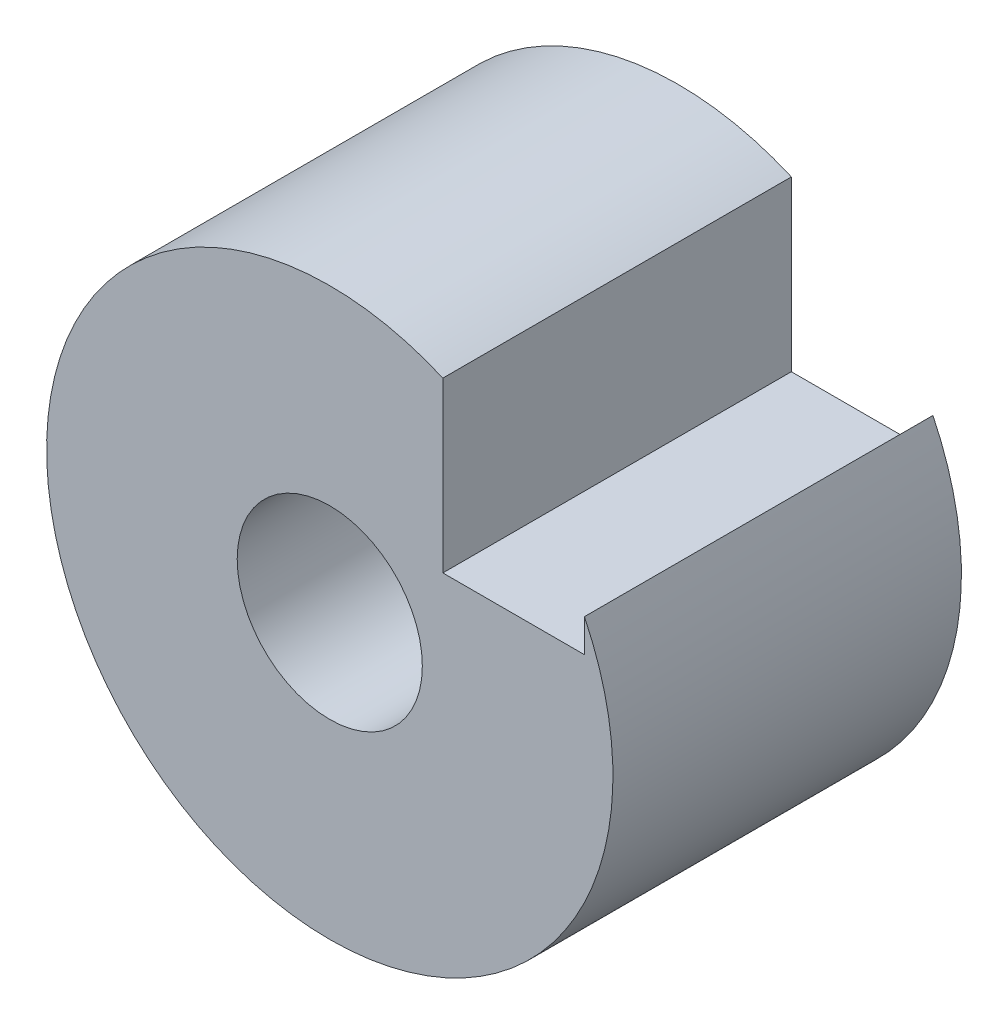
from build123d import *

# Parameters (mm, degrees)
SKETCH1_R           = 13
BOSS_EXTRUDE1_DEPTH = 16
SKETCH2_R           = 4.25
CUT_EXTRUDE1_DEPTH  = 16
SKETCH3_W           = 6.5
SKETCH3_H           = 11.428051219
CUT_EXTRUDE2_DEPTH  = 16


with BuildPart() as part:
    # Sketch1 → Boss-Extrude1 (new body)
    with BuildSketch(Plane.XY):
        Circle(SKETCH1_R)
    extrude(amount=BOSS_EXTRUDE1_DEPTH)

    # Sketch2 → Cut-Extrude1 (cut)
    with BuildSketch(Plane.XY.offset(16)):
        Circle(SKETCH2_R)
    extrude(amount=-CUT_EXTRUDE1_DEPTH, mode=Mode.SUBTRACT)

    # Sketch3 → Cut-Extrude2 (cut)
    with BuildSketch(Plane.XY.offset(16)):
        with Locations((8.44149465, 9.886413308)):
            Rectangle(SKETCH3_W, SKETCH3_H)
    extrude(amount=-CUT_EXTRUDE2_DEPTH, mode=Mode.SUBTRACT)


solid = part.part
